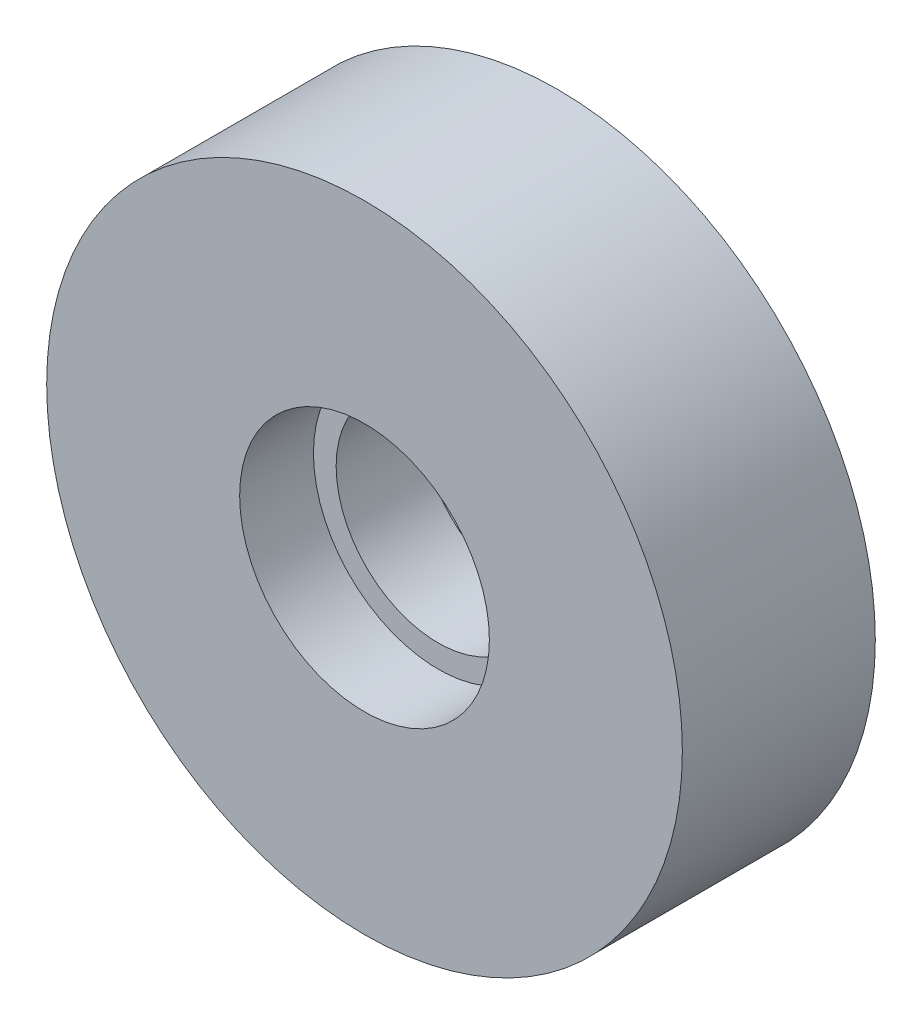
ISO-10303-21;
HEADER;
FILE_DESCRIPTION(('STEP AP214'),'2;1');
FILE_NAME('part.step','',(''),(''),'','','');
FILE_SCHEMA(('AUTOMOTIVE_DESIGN { 1 0 10303 214 1 1 1 1 }'));
ENDSEC;
DATA;
#1=APPLICATION_CONTEXT('core data for automotive mechanical design processes');
#2=APPLICATION_PROTOCOL_DEFINITION('international standard','automotive_design',2000,#1);
#3=PRODUCT_CONTEXT('',#1,'mechanical');
#4=PRODUCT('Part','Part','',(#3));
#5=PRODUCT_RELATED_PRODUCT_CATEGORY('part','',(#4));
#6=PRODUCT_DEFINITION_FORMATION('','',#4);
#7=PRODUCT_DEFINITION_CONTEXT('part definition',#1,'design');
#8=PRODUCT_DEFINITION('design','',#6,#7);
#9=PRODUCT_DEFINITION_SHAPE('','',#8);
#10=(LENGTH_UNIT() NAMED_UNIT(*) SI_UNIT(.MILLI.,.METRE.));
#11=(NAMED_UNIT(*) PLANE_ANGLE_UNIT() SI_UNIT($,.RADIAN.));
#12=(NAMED_UNIT(*) SI_UNIT($,.STERADIAN.) SOLID_ANGLE_UNIT());
#13=UNCERTAINTY_MEASURE_WITH_UNIT(LENGTH_MEASURE(1.E-05),#10,'distance_accuracy_value','');
#14=(GEOMETRIC_REPRESENTATION_CONTEXT(3) GLOBAL_UNCERTAINTY_ASSIGNED_CONTEXT((#13)) GLOBAL_UNIT_ASSIGNED_CONTEXT((#10,
#11,#12)) REPRESENTATION_CONTEXT('',''));
#15=CARTESIAN_POINT('',(0.,0.,0.));
#16=DIRECTION('',(0.,0.,1.));
#17=DIRECTION('',(1.,0.,0.));
#18=AXIS2_PLACEMENT_3D('',#15,#16,#17);
#19=CARTESIAN_POINT('',(0.,0.,-17.));
#20=DIRECTION('',(0.,0.,-1.));
#21=DIRECTION('',(1.,0.,0.));
#22=AXIS2_PLACEMENT_3D('',#19,#20,#21);
#23=PLANE('',#22);
#24=CARTESIAN_POINT('',(0.,0.,-17.));
#25=DIRECTION('',(0.,0.,1.));
#26=DIRECTION('',(1.,0.,0.));
#27=AXIS2_PLACEMENT_3D('',#24,#25,#26);
#28=CIRCLE('',#27,28.);
#29=CARTESIAN_POINT('',(28.,0.,-17.));
#30=VERTEX_POINT('',#29);
#31=EDGE_CURVE('E10',#30,#30,#28,.T.);
#32=ORIENTED_EDGE('',*,*,#31,.F.);
#33=EDGE_LOOP('',(#32));
#34=FACE_BOUND('',#33,.T.);
#35=CARTESIAN_POINT('',(0.,0.,-17.));
#36=DIRECTION('',(0.,0.,1.));
#37=DIRECTION('',(1.,0.,0.));
#38=AXIS2_PLACEMENT_3D('',#35,#36,#37);
#39=CIRCLE('',#38,15.0000000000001);
#40=CARTESIAN_POINT('',(15.0000000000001,0.,-17.));
#41=VERTEX_POINT('',#40);
#42=EDGE_CURVE('E62',#41,#41,#39,.T.);
#43=ORIENTED_EDGE('',*,*,#42,.T.);
#44=EDGE_LOOP('',(#43));
#45=FACE_BOUND('',#44,.T.);
#46=ADVANCED_FACE('F35',(#34,#45),#23,.T.);
#47=CARTESIAN_POINT('',(0.,0.,0.));
#48=DIRECTION('',(0.,0.,-1.));
#49=DIRECTION('',(1.,0.,0.));
#50=AXIS2_PLACEMENT_3D('',#47,#48,#49);
#51=CYLINDRICAL_SURFACE('',#50,9.);
#52=CARTESIAN_POINT('',(0.,0.,-14.));
#53=DIRECTION('',(0.,0.,1.));
#54=DIRECTION('',(1.,0.,0.));
#55=AXIS2_PLACEMENT_3D('',#52,#53,#54);
#56=CIRCLE('',#55,9.);
#57=CARTESIAN_POINT('',(9.,0.,-14.));
#58=VERTEX_POINT('',#57);
#59=EDGE_CURVE('E52',#58,#58,#56,.T.);
#60=ORIENTED_EDGE('',*,*,#59,.F.);
#61=EDGE_LOOP('',(#60));
#62=FACE_BOUND('',#61,.T.);
#63=CARTESIAN_POINT('',(0.,0.,-6.5));
#64=DIRECTION('',(0.,0.,-1.));
#65=DIRECTION('',(-1.,0.,0.));
#66=AXIS2_PLACEMENT_3D('',#63,#64,#65);
#67=CIRCLE('',#66,9.);
#68=CARTESIAN_POINT('',(-9.,0.,-6.5));
#69=VERTEX_POINT('',#68);
#70=EDGE_CURVE('E39',#69,#69,#67,.F.);
#71=ORIENTED_EDGE('',*,*,#70,.T.);
#72=EDGE_LOOP('',(#71));
#73=FACE_BOUND('',#72,.T.);
#74=ADVANCED_FACE('F89',(#62,#73),#51,.F.);
#75=CARTESIAN_POINT('',(0.,0.,-17.));
#76=DIRECTION('',(0.,0.,1.));
#77=DIRECTION('',(-1.,0.,0.));
#78=AXIS2_PLACEMENT_3D('',#75,#76,#77);
#79=CYLINDRICAL_SURFACE('',#78,28.);
#80=ORIENTED_EDGE('',*,*,#31,.T.);
#81=EDGE_LOOP('',(#80));
#82=FACE_BOUND('',#81,.T.);
#83=CARTESIAN_POINT('',(0.,0.,0.));
#84=DIRECTION('',(0.,0.,1.));
#85=DIRECTION('',(1.,0.,0.));
#86=AXIS2_PLACEMENT_3D('',#83,#84,#85);
#87=CIRCLE('',#86,28.);
#88=CARTESIAN_POINT('',(28.,0.,0.));
#89=VERTEX_POINT('',#88);
#90=EDGE_CURVE('E43',#89,#89,#87,.T.);
#91=ORIENTED_EDGE('',*,*,#90,.F.);
#92=EDGE_LOOP('',(#91));
#93=FACE_BOUND('',#92,.T.);
#94=ADVANCED_FACE('F37',(#82,#93),#79,.T.);
#95=CARTESIAN_POINT('',(0.,0.,0.));
#96=DIRECTION('',(0.,0.,-1.));
#97=DIRECTION('',(1.,0.,0.));
#98=AXIS2_PLACEMENT_3D('',#95,#96,#97);
#99=PLANE('',#98);
#100=CARTESIAN_POINT('',(0.,0.,0.));
#101=DIRECTION('',(0.,0.,-1.));
#102=DIRECTION('',(-1.,0.,0.));
#103=AXIS2_PLACEMENT_3D('',#100,#101,#102);
#104=CIRCLE('',#103,11.);
#105=CARTESIAN_POINT('',(-11.,0.,0.));
#106=VERTEX_POINT('',#105);
#107=EDGE_CURVE('E55',#106,#106,#104,.T.);
#108=ORIENTED_EDGE('',*,*,#107,.T.);
#109=EDGE_LOOP('',(#108));
#110=FACE_BOUND('',#109,.T.);
#111=ORIENTED_EDGE('',*,*,#90,.T.);
#112=EDGE_LOOP('',(#111));
#113=FACE_BOUND('',#112,.T.);
#114=ADVANCED_FACE('F76',(#110,#113),#99,.F.);
#115=CARTESIAN_POINT('',(0.,0.,-14.));
#116=DIRECTION('',(0.,0.,-1.));
#117=DIRECTION('',(1.,0.,0.));
#118=AXIS2_PLACEMENT_3D('',#115,#116,#117);
#119=CYLINDRICAL_SURFACE('',#118,11.);
#120=CARTESIAN_POINT('',(0.,0.,-14.));
#121=DIRECTION('',(0.,0.,1.));
#122=DIRECTION('',(1.,0.,0.));
#123=AXIS2_PLACEMENT_3D('',#120,#121,#122);
#124=CIRCLE('',#123,11.);
#125=CARTESIAN_POINT('',(11.,0.,-14.));
#126=VERTEX_POINT('',#125);
#127=EDGE_CURVE('E48',#126,#126,#124,.T.);
#128=ORIENTED_EDGE('',*,*,#127,.T.);
#129=EDGE_LOOP('',(#128));
#130=FACE_BOUND('',#129,.T.);
#131=CARTESIAN_POINT('',(0.,0.,-21.));
#132=DIRECTION('',(0.,0.,1.));
#133=DIRECTION('',(1.,0.,0.));
#134=AXIS2_PLACEMENT_3D('',#131,#132,#133);
#135=CIRCLE('',#134,11.);
#136=CARTESIAN_POINT('',(11.,0.,-21.));
#137=VERTEX_POINT('',#136);
#138=EDGE_CURVE('E65',#137,#137,#135,.T.);
#139=ORIENTED_EDGE('',*,*,#138,.F.);
#140=EDGE_LOOP('',(#139));
#141=FACE_BOUND('',#140,.T.);
#142=ADVANCED_FACE('F73',(#130,#141),#119,.F.);
#143=CARTESIAN_POINT('',(0.,0.,-14.));
#144=DIRECTION('',(0.,0.,-1.));
#145=DIRECTION('',(1.,0.,0.));
#146=AXIS2_PLACEMENT_3D('',#143,#144,#145);
#147=PLANE('',#146);
#148=ORIENTED_EDGE('',*,*,#59,.T.);
#149=EDGE_LOOP('',(#148));
#150=FACE_BOUND('',#149,.T.);
#151=ORIENTED_EDGE('',*,*,#127,.F.);
#152=EDGE_LOOP('',(#151));
#153=FACE_BOUND('',#152,.T.);
#154=ADVANCED_FACE('F75',(#150,#153),#147,.T.);
#155=CARTESIAN_POINT('',(0.,0.,-6.5));
#156=DIRECTION('',(0.,0.,1.));
#157=DIRECTION('',(-1.,0.,0.));
#158=AXIS2_PLACEMENT_3D('',#155,#156,#157);
#159=PLANE('',#158);
#160=CARTESIAN_POINT('',(0.,0.,-6.5));
#161=DIRECTION('',(0.,0.,-1.));
#162=DIRECTION('',(-1.,0.,0.));
#163=AXIS2_PLACEMENT_3D('',#160,#161,#162);
#164=CIRCLE('',#163,11.);
#165=CARTESIAN_POINT('',(-11.,0.,-6.5));
#166=VERTEX_POINT('',#165);
#167=EDGE_CURVE('E58',#166,#166,#164,.T.);
#168=ORIENTED_EDGE('',*,*,#167,.F.);
#169=EDGE_LOOP('',(#168));
#170=FACE_BOUND('',#169,.T.);
#171=ORIENTED_EDGE('',*,*,#70,.F.);
#172=EDGE_LOOP('',(#171));
#173=FACE_BOUND('',#172,.T.);
#174=ADVANCED_FACE('F83',(#170,#173),#159,.T.);
#175=CARTESIAN_POINT('',(0.,0.,-6.5));
#176=DIRECTION('',(0.,0.,1.));
#177=DIRECTION('',(-1.,0.,0.));
#178=AXIS2_PLACEMENT_3D('',#175,#176,#177);
#179=CYLINDRICAL_SURFACE('',#178,11.);
#180=CARTESIAN_POINT('',(-11.,0.,-6.5));
#181=CARTESIAN_POINT('',(-11.,0.,-6.43229166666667));
#182=CARTESIAN_POINT('',(-11.,0.,-6.36458333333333));
#183=CARTESIAN_POINT('',(-11.,0.,-6.22916666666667));
#184=CARTESIAN_POINT('',(-11.,0.,-6.16145833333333));
#185=CARTESIAN_POINT('',(-11.,0.,-6.02604166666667));
#186=CARTESIAN_POINT('',(-11.,0.,-5.95833333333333));
#187=CARTESIAN_POINT('',(-11.,0.,-5.82291666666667));
#188=CARTESIAN_POINT('',(-11.,0.,-5.75520833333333));
#189=CARTESIAN_POINT('',(-11.,0.,-5.61979166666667));
#190=CARTESIAN_POINT('',(-11.,0.,-5.55208333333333));
#191=CARTESIAN_POINT('',(-11.,0.,-5.41666666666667));
#192=CARTESIAN_POINT('',(-11.,0.,-5.34895833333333));
#193=CARTESIAN_POINT('',(-11.,0.,-5.21354166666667));
#194=CARTESIAN_POINT('',(-11.,0.,-5.14583333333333));
#195=CARTESIAN_POINT('',(-11.,0.,-5.01041666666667));
#196=CARTESIAN_POINT('',(-11.,0.,-4.94270833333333));
#197=CARTESIAN_POINT('',(-11.,0.,-4.80729166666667));
#198=CARTESIAN_POINT('',(-11.,0.,-4.73958333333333));
#199=CARTESIAN_POINT('',(-11.,0.,-4.60416666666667));
#200=CARTESIAN_POINT('',(-11.,0.,-4.53645833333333));
#201=CARTESIAN_POINT('',(-11.,0.,-4.40104166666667));
#202=CARTESIAN_POINT('',(-11.,0.,-4.33333333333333));
#203=CARTESIAN_POINT('',(-11.,0.,-4.19791666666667));
#204=CARTESIAN_POINT('',(-11.,0.,-4.13020833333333));
#205=CARTESIAN_POINT('',(-11.,0.,-3.99479166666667));
#206=CARTESIAN_POINT('',(-11.,0.,-3.92708333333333));
#207=CARTESIAN_POINT('',(-11.,0.,-3.79166666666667));
#208=CARTESIAN_POINT('',(-11.,0.,-3.72395833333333));
#209=CARTESIAN_POINT('',(-11.,0.,-3.58854166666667));
#210=CARTESIAN_POINT('',(-11.,0.,-3.52083333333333));
#211=CARTESIAN_POINT('',(-11.,0.,-3.38541666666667));
#212=CARTESIAN_POINT('',(-11.,0.,-3.31770833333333));
#213=CARTESIAN_POINT('',(-11.,0.,-3.18229166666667));
#214=CARTESIAN_POINT('',(-11.,0.,-3.11458333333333));
#215=CARTESIAN_POINT('',(-11.,0.,-2.97916666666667));
#216=CARTESIAN_POINT('',(-11.,0.,-2.91145833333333));
#217=CARTESIAN_POINT('',(-11.,0.,-2.77604166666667));
#218=CARTESIAN_POINT('',(-11.,0.,-2.70833333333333));
#219=CARTESIAN_POINT('',(-11.,0.,-2.57291666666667));
#220=CARTESIAN_POINT('',(-11.,0.,-2.50520833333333));
#221=CARTESIAN_POINT('',(-11.,0.,-2.36979166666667));
#222=CARTESIAN_POINT('',(-11.,0.,-2.30208333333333));
#223=CARTESIAN_POINT('',(-11.,0.,-2.16666666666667));
#224=CARTESIAN_POINT('',(-11.,0.,-2.09895833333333));
#225=CARTESIAN_POINT('',(-11.,0.,-1.96354166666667));
#226=CARTESIAN_POINT('',(-11.,0.,-1.89583333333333));
#227=CARTESIAN_POINT('',(-11.,0.,-1.76041666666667));
#228=CARTESIAN_POINT('',(-11.,0.,-1.69270833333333));
#229=CARTESIAN_POINT('',(-11.,0.,-1.55729166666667));
#230=CARTESIAN_POINT('',(-11.,0.,-1.48958333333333));
#231=CARTESIAN_POINT('',(-11.,0.,-1.35416666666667));
#232=CARTESIAN_POINT('',(-11.,0.,-1.28645833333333));
#233=CARTESIAN_POINT('',(-11.,0.,-1.15104166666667));
#234=CARTESIAN_POINT('',(-11.,0.,-1.08333333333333));
#235=CARTESIAN_POINT('',(-11.,0.,-0.947916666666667));
#236=CARTESIAN_POINT('',(-11.,0.,-0.880208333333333));
#237=CARTESIAN_POINT('',(-11.,0.,-0.744791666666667));
#238=CARTESIAN_POINT('',(-11.,0.,-0.677083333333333));
#239=CARTESIAN_POINT('',(-11.,0.,-0.541666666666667));
#240=CARTESIAN_POINT('',(-11.,0.,-0.473958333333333));
#241=CARTESIAN_POINT('',(-11.,0.,-0.338541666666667));
#242=CARTESIAN_POINT('',(-11.,0.,-0.270833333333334));
#243=CARTESIAN_POINT('',(-11.,0.,-0.135416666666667));
#244=CARTESIAN_POINT('',(-11.,0.,-0.0677083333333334));
#245=CARTESIAN_POINT('',(-11.,0.,0.));
#246=B_SPLINE_CURVE_WITH_KNOTS('',3,(#180,#181,#182,#183,#184,#185,#186,#187,#188,#189,#190,
#191,#192,#193,#194,#195,#196,#197,#198,#199,#200,#201,#202,#203,#204,#205,#206,#207,#208,#209,
#210,#211,#212,#213,#214,#215,#216,#217,#218,#219,#220,#221,#222,#223,#224,#225,#226,#227,#228,
#229,#230,#231,#232,#233,#234,#235,#236,#237,#238,#239,#240,#241,#242,#243,#244,#245),
.UNSPECIFIED.,.F.,.F.,(4,2,2,2,2,2,2,2,2,2,2,2,2,2,2,2,2,2,2,2,2,2,2,2,2,2,2,2,2,2,2,2,4),(0.,
0.203125,0.40625,0.609375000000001,0.812500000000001,1.015625,1.21875,1.421875,1.625,1.828125,
2.03125,2.234375,2.4375,2.640625,2.84375,3.046875,3.25,3.453125,3.65625,3.859375,4.0625,
4.265625,4.46875,4.671875,4.875,5.078125,5.28125,5.484375,5.6875,5.890625,6.09375,6.296875,6.5),.UNSPECIFIED.);
#247=EDGE_CURVE('BSEAM106',#166,#106,#246,.T.);
#248=ORIENTED_EDGE('',*,*,#167,.T.);
#249=ORIENTED_EDGE('',*,*,#107,.F.);
#250=ORIENTED_EDGE('',*,*,#247,.T.);
#251=ORIENTED_EDGE('',*,*,#247,.F.);
#252=EDGE_LOOP('',(#248,#250,#249,#251));
#253=FACE_BOUND('',#252,.T.);
#254=ADVANCED_FACE('F106',(#253),#179,.F.);
#255=CARTESIAN_POINT('',(0.,0.,-21.));
#256=DIRECTION('',(0.,0.,-1.));
#257=DIRECTION('',(1.,0.,0.));
#258=AXIS2_PLACEMENT_3D('',#255,#256,#257);
#259=PLANE('',#258);
#260=CARTESIAN_POINT('',(0.,0.,-21.));
#261=DIRECTION('',(0.,0.,1.));
#262=DIRECTION('',(1.,0.,0.));
#263=AXIS2_PLACEMENT_3D('',#260,#261,#262);
#264=CIRCLE('',#263,15.0000000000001);
#265=CARTESIAN_POINT('',(15.0000000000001,0.,-21.));
#266=VERTEX_POINT('',#265);
#267=EDGE_CURVE('E59',#266,#266,#264,.T.);
#268=ORIENTED_EDGE('',*,*,#267,.F.);
#269=EDGE_LOOP('',(#268));
#270=FACE_BOUND('',#269,.T.);
#271=ORIENTED_EDGE('',*,*,#138,.T.);
#272=EDGE_LOOP('',(#271));
#273=FACE_BOUND('',#272,.T.);
#274=ADVANCED_FACE('F71',(#270,#273),#259,.T.);
#275=CARTESIAN_POINT('',(0.,0.,-21.));
#276=DIRECTION('',(0.,0.,1.));
#277=DIRECTION('',(-1.,0.,0.));
#278=AXIS2_PLACEMENT_3D('',#275,#276,#277);
#279=CYLINDRICAL_SURFACE('',#278,15.0000000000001);
#280=ORIENTED_EDGE('',*,*,#267,.T.);
#281=EDGE_LOOP('',(#280));
#282=FACE_BOUND('',#281,.T.);
#283=ORIENTED_EDGE('',*,*,#42,.F.);
#284=EDGE_LOOP('',(#283));
#285=FACE_BOUND('',#284,.T.);
#286=ADVANCED_FACE('F99',(#282,#285),#279,.T.);
#287=CLOSED_SHELL('',(#46,#74,#94,#114,#142,#154,#174,#254,#274,#286));
#288=MANIFOLD_SOLID_BREP('B2',#287);
#289=ADVANCED_BREP_SHAPE_REPRESENTATION('',(#18,#288),#14);
#290=SHAPE_DEFINITION_REPRESENTATION(#9,#289);
ENDSEC;
END-ISO-10303-21;
